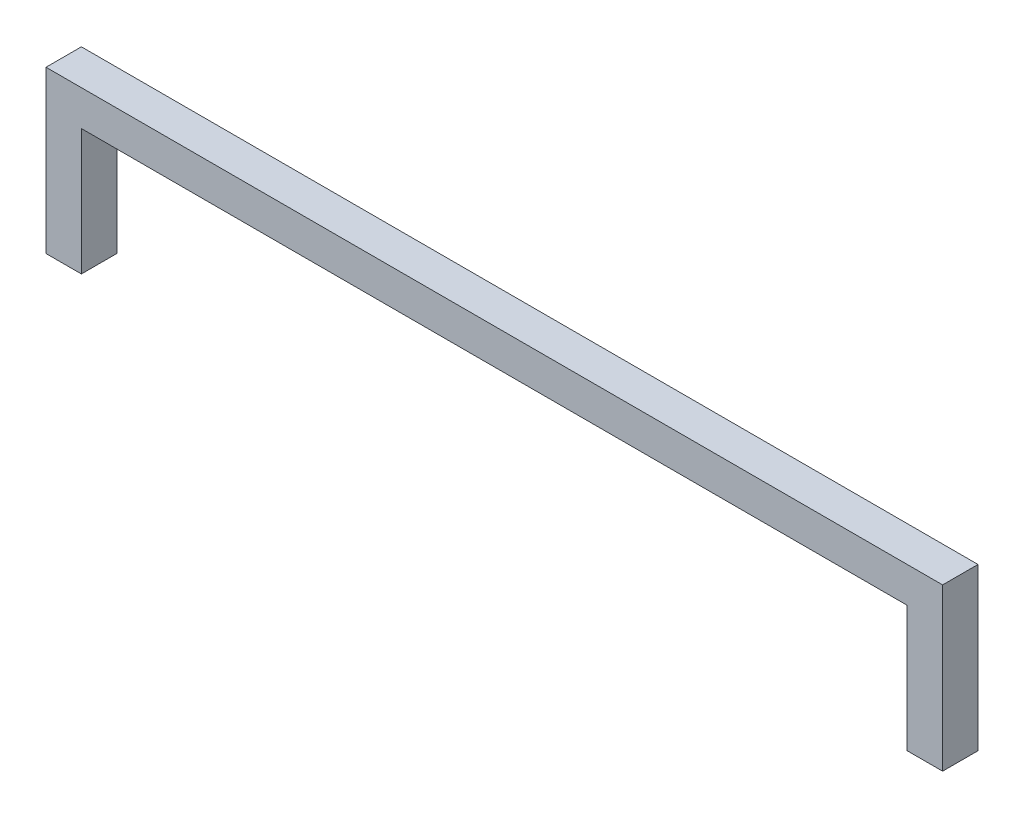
ISO-10303-21;
HEADER;
FILE_DESCRIPTION(('STEP AP214'),'2;1');
FILE_NAME('part.step','',(''),(''),'','','');
FILE_SCHEMA(('AUTOMOTIVE_DESIGN { 1 0 10303 214 1 1 1 1 }'));
ENDSEC;
DATA;
#1=APPLICATION_CONTEXT('core data for automotive mechanical design processes');
#2=APPLICATION_PROTOCOL_DEFINITION('international standard','automotive_design',2000,#1);
#3=PRODUCT_CONTEXT('',#1,'mechanical');
#4=PRODUCT('Part','Part','',(#3));
#5=PRODUCT_RELATED_PRODUCT_CATEGORY('part','',(#4));
#6=PRODUCT_DEFINITION_FORMATION('','',#4);
#7=PRODUCT_DEFINITION_CONTEXT('part definition',#1,'design');
#8=PRODUCT_DEFINITION('design','',#6,#7);
#9=PRODUCT_DEFINITION_SHAPE('','',#8);
#10=(LENGTH_UNIT() NAMED_UNIT(*) SI_UNIT(.MILLI.,.METRE.));
#11=(NAMED_UNIT(*) PLANE_ANGLE_UNIT() SI_UNIT($,.RADIAN.));
#12=(NAMED_UNIT(*) SI_UNIT($,.STERADIAN.) SOLID_ANGLE_UNIT());
#13=UNCERTAINTY_MEASURE_WITH_UNIT(LENGTH_MEASURE(1.E-05),#10,'distance_accuracy_value','');
#14=(GEOMETRIC_REPRESENTATION_CONTEXT(3) GLOBAL_UNCERTAINTY_ASSIGNED_CONTEXT((#13)) GLOBAL_UNIT_ASSIGNED_CONTEXT((#10,
#11,#12)) REPRESENTATION_CONTEXT('',''));
#15=CARTESIAN_POINT('',(0.,0.,0.));
#16=DIRECTION('',(0.,0.,1.));
#17=DIRECTION('',(1.,0.,0.));
#18=AXIS2_PLACEMENT_3D('',#15,#16,#17);
#19=CARTESIAN_POINT('',(700.,0.,0.));
#20=DIRECTION('',(0.,1.,0.));
#21=DIRECTION('',(0.,0.,-1.));
#22=AXIS2_PLACEMENT_3D('',#19,#20,#21);
#23=PLANE('',#22);
#24=DIRECTION('',(0.,0.,-1.));
#25=VECTOR('',#24,1.);
#26=CARTESIAN_POINT('',(700.,0.,0.));
#27=LINE('',#26,#25);
#28=CARTESIAN_POINT('',(700.,0.,30.));
#29=VERTEX_POINT('',#28);
#30=CARTESIAN_POINT('',(700.,0.,0.));
#31=VERTEX_POINT('',#30);
#32=EDGE_CURVE('E303',#29,#31,#27,.T.);
#33=ORIENTED_EDGE('',*,*,#32,.T.);
#34=DIRECTION('',(1.,0.,0.));
#35=VECTOR('',#34,1.);
#36=CARTESIAN_POINT('',(700.,0.,0.));
#37=LINE('',#36,#35);
#38=CARTESIAN_POINT('',(730.,0.,0.));
#39=VERTEX_POINT('',#38);
#40=EDGE_CURVE('E300',#31,#39,#37,.T.);
#41=ORIENTED_EDGE('',*,*,#40,.T.);
#42=DIRECTION('',(0.,0.,1.));
#43=VECTOR('',#42,1.);
#44=CARTESIAN_POINT('',(730.,0.,0.));
#45=LINE('',#44,#43);
#46=CARTESIAN_POINT('',(730.,0.,30.));
#47=VERTEX_POINT('',#46);
#48=EDGE_CURVE('E309',#39,#47,#45,.T.);
#49=ORIENTED_EDGE('',*,*,#48,.T.);
#50=DIRECTION('',(-1.,0.,0.));
#51=VECTOR('',#50,1.);
#52=CARTESIAN_POINT('',(700.,0.,30.));
#53=LINE('',#52,#51);
#54=EDGE_CURVE('E306',#47,#29,#53,.T.);
#55=ORIENTED_EDGE('',*,*,#54,.T.);
#56=EDGE_LOOP('',(#33,#41,#49,#55));
#57=FACE_BOUND('',#56,.T.);
#58=DIRECTION('',(0.,0.,-1.));
#59=VECTOR('',#58,1.);
#60=CARTESIAN_POINT('',(701.,0.,0.));
#61=LINE('',#60,#59);
#62=CARTESIAN_POINT('',(701.,0.,29.));
#63=VERTEX_POINT('',#62);
#64=CARTESIAN_POINT('',(701.,0.,1.));
#65=VERTEX_POINT('',#64);
#66=EDGE_CURVE('E221',#63,#65,#61,.T.);
#67=ORIENTED_EDGE('',*,*,#66,.F.);
#68=DIRECTION('',(-1.,0.,0.));
#69=VECTOR('',#68,1.);
#70=CARTESIAN_POINT('',(700.,0.,29.));
#71=LINE('',#70,#69);
#72=CARTESIAN_POINT('',(729.,0.,29.));
#73=VERTEX_POINT('',#72);
#74=EDGE_CURVE('E218',#73,#63,#71,.T.);
#75=ORIENTED_EDGE('',*,*,#74,.F.);
#76=DIRECTION('',(0.,0.,1.));
#77=VECTOR('',#76,1.);
#78=CARTESIAN_POINT('',(729.,0.,0.));
#79=LINE('',#78,#77);
#80=CARTESIAN_POINT('',(729.,0.,1.));
#81=VERTEX_POINT('',#80);
#82=EDGE_CURVE('E176',#81,#73,#79,.T.);
#83=ORIENTED_EDGE('',*,*,#82,.F.);
#84=DIRECTION('',(1.,0.,0.));
#85=VECTOR('',#84,1.);
#86=CARTESIAN_POINT('',(700.,0.,1.));
#87=LINE('',#86,#85);
#88=EDGE_CURVE('E224',#65,#81,#87,.T.);
#89=ORIENTED_EDGE('',*,*,#88,.F.);
#90=EDGE_LOOP('',(#67,#75,#83,#89));
#91=FACE_BOUND('',#90,.T.);
#92=ADVANCED_FACE('F46',(#57,#91),#23,.F.);
#93=CARTESIAN_POINT('',(0.,0.,0.));
#94=DIRECTION('',(0.,-1.,0.));
#95=DIRECTION('',(0.,0.,-1.));
#96=AXIS2_PLACEMENT_3D('',#93,#94,#95);
#97=PLANE('',#96);
#98=DIRECTION('',(0.,0.,-1.));
#99=VECTOR('',#98,1.);
#100=CARTESIAN_POINT('',(0.,0.,0.));
#101=LINE('',#100,#99);
#102=CARTESIAN_POINT('',(0.,0.,30.));
#103=VERTEX_POINT('',#102);
#104=CARTESIAN_POINT('',(0.,0.,0.));
#105=VERTEX_POINT('',#104);
#106=EDGE_CURVE('E260',#103,#105,#101,.T.);
#107=ORIENTED_EDGE('',*,*,#106,.F.);
#108=DIRECTION('',(1.,0.,0.));
#109=VECTOR('',#108,1.);
#110=CARTESIAN_POINT('',(0.,0.,30.));
#111=LINE('',#110,#109);
#112=CARTESIAN_POINT('',(-30.,0.,30.));
#113=VERTEX_POINT('',#112);
#114=EDGE_CURVE('E245',#113,#103,#111,.T.);
#115=ORIENTED_EDGE('',*,*,#114,.F.);
#116=DIRECTION('',(0.,0.,1.));
#117=VECTOR('',#116,1.);
#118=CARTESIAN_POINT('',(-30.,0.,0.));
#119=LINE('',#118,#117);
#120=CARTESIAN_POINT('',(-30.,0.,0.));
#121=VERTEX_POINT('',#120);
#122=EDGE_CURVE('E241',#121,#113,#119,.T.);
#123=ORIENTED_EDGE('',*,*,#122,.F.);
#124=DIRECTION('',(-1.,0.,0.));
#125=VECTOR('',#124,1.);
#126=CARTESIAN_POINT('',(0.,0.,0.));
#127=LINE('',#126,#125);
#128=EDGE_CURVE('E256',#105,#121,#127,.T.);
#129=ORIENTED_EDGE('',*,*,#128,.F.);
#130=EDGE_LOOP('',(#107,#115,#123,#129));
#131=FACE_BOUND('',#130,.T.);
#132=DIRECTION('',(1.,0.,0.));
#133=VECTOR('',#132,1.);
#134=CARTESIAN_POINT('',(0.,0.,29.));
#135=LINE('',#134,#133);
#136=CARTESIAN_POINT('',(-29.,0.,29.));
#137=VERTEX_POINT('',#136);
#138=CARTESIAN_POINT('',(-0.999999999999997,0.,29.));
#139=VERTEX_POINT('',#138);
#140=EDGE_CURVE('E233',#137,#139,#135,.T.);
#141=ORIENTED_EDGE('',*,*,#140,.T.);
#142=DIRECTION('',(0.,0.,-1.));
#143=VECTOR('',#142,1.);
#144=CARTESIAN_POINT('',(-1.,0.,0.));
#145=LINE('',#144,#143);
#146=CARTESIAN_POINT('',(-1.,0.,1.));
#147=VERTEX_POINT('',#146);
#148=EDGE_CURVE('E230',#139,#147,#145,.T.);
#149=ORIENTED_EDGE('',*,*,#148,.T.);
#150=DIRECTION('',(-1.,0.,0.));
#151=VECTOR('',#150,1.);
#152=CARTESIAN_POINT('',(0.,0.,1.));
#153=LINE('',#152,#151);
#154=CARTESIAN_POINT('',(-29.,0.,1.));
#155=VERTEX_POINT('',#154);
#156=EDGE_CURVE('E205',#147,#155,#153,.T.);
#157=ORIENTED_EDGE('',*,*,#156,.T.);
#158=DIRECTION('',(0.,0.,1.));
#159=VECTOR('',#158,1.);
#160=CARTESIAN_POINT('',(-29.,0.,0.));
#161=LINE('',#160,#159);
#162=EDGE_CURVE('E237',#155,#137,#161,.T.);
#163=ORIENTED_EDGE('',*,*,#162,.T.);
#164=EDGE_LOOP('',(#141,#149,#157,#163));
#165=FACE_BOUND('',#164,.T.);
#166=ADVANCED_FACE('F343',(#131,#165),#97,.T.);
#167=CARTESIAN_POINT('',(730.,139.87,0.));
#168=DIRECTION('',(1.,0.,0.));
#169=DIRECTION('',(0.,0.,-1.));
#170=AXIS2_PLACEMENT_3D('',#167,#168,#169);
#171=PLANE('',#170);
#172=DIRECTION('',(0.,0.,-1.));
#173=VECTOR('',#172,1.);
#174=CARTESIAN_POINT('',(730.,136.77,-3.48106075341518E-13));
#175=LINE('',#174,#173);
#176=CARTESIAN_POINT('',(730.,136.77,30.));
#177=VERTEX_POINT('',#176);
#178=CARTESIAN_POINT('',(730.,136.77,0.));
#179=VERTEX_POINT('',#178);
#180=EDGE_CURVE('E280',#177,#179,#175,.T.);
#181=ORIENTED_EDGE('',*,*,#180,.F.);
#182=DIRECTION('',(0.,-1.,0.));
#183=VECTOR('',#182,1.);
#184=CARTESIAN_POINT('',(730.,139.87,30.));
#185=LINE('',#184,#183);
#186=EDGE_CURVE('E319',#177,#47,#185,.T.);
#187=ORIENTED_EDGE('',*,*,#186,.T.);
#188=ORIENTED_EDGE('',*,*,#48,.F.);
#189=DIRECTION('',(0.,-1.,0.));
#190=VECTOR('',#189,1.);
#191=CARTESIAN_POINT('',(730.,139.87,0.));
#192=LINE('',#191,#190);
#193=EDGE_CURVE('E49',#179,#39,#192,.T.);
#194=ORIENTED_EDGE('',*,*,#193,.F.);
#195=EDGE_LOOP('',(#181,#187,#188,#194));
#196=FACE_BOUND('',#195,.T.);
#197=ADVANCED_FACE('F331',(#196),#171,.T.);
#198=CARTESIAN_POINT('',(700.,139.87,0.));
#199=DIRECTION('',(-1.,0.,0.));
#200=DIRECTION('',(0.,0.,1.));
#201=AXIS2_PLACEMENT_3D('',#198,#199,#200);
#202=PLANE('',#201);
#203=DIRECTION('',(0.,0.,1.));
#204=VECTOR('',#203,1.);
#205=CARTESIAN_POINT('',(700.,106.77,0.));
#206=LINE('',#205,#204);
#207=CARTESIAN_POINT('',(700.,106.77,0.));
#208=VERTEX_POINT('',#207);
#209=CARTESIAN_POINT('',(700.,106.77,30.));
#210=VERTEX_POINT('',#209);
#211=EDGE_CURVE('E246',#208,#210,#206,.T.);
#212=ORIENTED_EDGE('',*,*,#211,.F.);
#213=DIRECTION('',(0.,-1.,0.));
#214=VECTOR('',#213,1.);
#215=CARTESIAN_POINT('',(700.,139.87,0.));
#216=LINE('',#215,#214);
#217=EDGE_CURVE('E312',#208,#31,#216,.T.);
#218=ORIENTED_EDGE('',*,*,#217,.T.);
#219=ORIENTED_EDGE('',*,*,#32,.F.);
#220=DIRECTION('',(0.,-1.,0.));
#221=VECTOR('',#220,1.);
#222=CARTESIAN_POINT('',(700.,139.87,30.));
#223=LINE('',#222,#221);
#224=EDGE_CURVE('E316',#210,#29,#223,.T.);
#225=ORIENTED_EDGE('',*,*,#224,.F.);
#226=EDGE_LOOP('',(#212,#218,#219,#225));
#227=FACE_BOUND('',#226,.T.);
#228=ADVANCED_FACE('F353',(#227),#202,.T.);
#229=CARTESIAN_POINT('',(-33.1,106.77,0.));
#230=DIRECTION('',(0.,-1.,0.));
#231=DIRECTION('',(0.,0.,-1.));
#232=AXIS2_PLACEMENT_3D('',#229,#230,#231);
#233=PLANE('',#232);
#234=DIRECTION('',(1.,0.,0.));
#235=VECTOR('',#234,1.);
#236=CARTESIAN_POINT('',(-33.1,106.77,0.));
#237=LINE('',#236,#235);
#238=CARTESIAN_POINT('',(0.,106.77,0.));
#239=VERTEX_POINT('',#238);
#240=EDGE_CURVE('E281',#239,#208,#237,.T.);
#241=ORIENTED_EDGE('',*,*,#240,.T.);
#242=ORIENTED_EDGE('',*,*,#211,.T.);
#243=DIRECTION('',(1.,0.,0.));
#244=VECTOR('',#243,1.);
#245=CARTESIAN_POINT('',(-33.1,106.77,30.));
#246=LINE('',#245,#244);
#247=CARTESIAN_POINT('',(0.,106.77,30.));
#248=VERTEX_POINT('',#247);
#249=EDGE_CURVE('E285',#248,#210,#246,.T.);
#250=ORIENTED_EDGE('',*,*,#249,.F.);
#251=DIRECTION('',(0.,0.,1.));
#252=VECTOR('',#251,1.);
#253=CARTESIAN_POINT('',(0.,106.77,0.));
#254=LINE('',#253,#252);
#255=EDGE_CURVE('E11',#239,#248,#254,.T.);
#256=ORIENTED_EDGE('',*,*,#255,.F.);
#257=EDGE_LOOP('',(#241,#242,#250,#256));
#258=FACE_BOUND('',#257,.T.);
#259=ADVANCED_FACE('F351',(#258),#233,.T.);
#260=CARTESIAN_POINT('',(-33.1,136.77,0.));
#261=DIRECTION('',(0.,1.,0.));
#262=DIRECTION('',(0.,0.,1.));
#263=AXIS2_PLACEMENT_3D('',#260,#261,#262);
#264=PLANE('',#263);
#265=DIRECTION('',(1.,0.,0.));
#266=VECTOR('',#265,1.);
#267=CARTESIAN_POINT('',(-33.1,136.77,30.));
#268=LINE('',#267,#266);
#269=CARTESIAN_POINT('',(-30.,136.77,30.));
#270=VERTEX_POINT('',#269);
#271=EDGE_CURVE('E289',#270,#177,#268,.T.);
#272=ORIENTED_EDGE('',*,*,#271,.T.);
#273=ORIENTED_EDGE('',*,*,#180,.T.);
#274=DIRECTION('',(1.,0.,0.));
#275=VECTOR('',#274,1.);
#276=CARTESIAN_POINT('',(-33.1,136.77,0.));
#277=LINE('',#276,#275);
#278=CARTESIAN_POINT('',(-30.,136.77,0.));
#279=VERTEX_POINT('',#278);
#280=EDGE_CURVE('E293',#279,#179,#277,.T.);
#281=ORIENTED_EDGE('',*,*,#280,.F.);
#282=DIRECTION('',(0.,0.,-1.));
#283=VECTOR('',#282,1.);
#284=CARTESIAN_POINT('',(-30.,136.77,0.));
#285=LINE('',#284,#283);
#286=EDGE_CURVE('E55',#270,#279,#285,.T.);
#287=ORIENTED_EDGE('',*,*,#286,.F.);
#288=EDGE_LOOP('',(#272,#273,#281,#287));
#289=FACE_BOUND('',#288,.T.);
#290=ADVANCED_FACE('F333',(#289),#264,.T.);
#291=CARTESIAN_POINT('',(0.,0.,0.));
#292=DIRECTION('',(0.,0.,-1.));
#293=DIRECTION('',(-1.,0.,0.));
#294=AXIS2_PLACEMENT_3D('',#291,#292,#293);
#295=PLANE('',#294);
#296=DIRECTION('',(0.,1.,0.));
#297=VECTOR('',#296,1.);
#298=CARTESIAN_POINT('',(-30.,0.,0.));
#299=LINE('',#298,#297);
#300=EDGE_CURVE('E252',#121,#279,#299,.T.);
#301=ORIENTED_EDGE('',*,*,#300,.T.);
#302=ORIENTED_EDGE('',*,*,#280,.T.);
#303=ORIENTED_EDGE('',*,*,#193,.T.);
#304=ORIENTED_EDGE('',*,*,#40,.F.);
#305=ORIENTED_EDGE('',*,*,#217,.F.);
#306=ORIENTED_EDGE('',*,*,#240,.F.);
#307=DIRECTION('',(0.,1.,0.));
#308=VECTOR('',#307,1.);
#309=CARTESIAN_POINT('',(0.,0.,0.));
#310=LINE('',#309,#308);
#311=EDGE_CURVE('E264',#105,#239,#310,.T.);
#312=ORIENTED_EDGE('',*,*,#311,.F.);
#313=ORIENTED_EDGE('',*,*,#128,.T.);
#314=EDGE_LOOP('',(#301,#302,#303,#304,#305,#306,#312,#313));
#315=FACE_BOUND('',#314,.T.);
#316=ADVANCED_FACE('F329',(#315),#295,.T.);
#317=CARTESIAN_POINT('',(0.,0.,0.));
#318=DIRECTION('',(1.,0.,0.));
#319=DIRECTION('',(0.,0.,-1.));
#320=AXIS2_PLACEMENT_3D('',#317,#318,#319);
#321=PLANE('',#320);
#322=ORIENTED_EDGE('',*,*,#311,.T.);
#323=ORIENTED_EDGE('',*,*,#255,.T.);
#324=DIRECTION('',(0.,1.,0.));
#325=VECTOR('',#324,1.);
#326=CARTESIAN_POINT('',(0.,0.,30.));
#327=LINE('',#326,#325);
#328=EDGE_CURVE('E251',#103,#248,#327,.T.);
#329=ORIENTED_EDGE('',*,*,#328,.F.);
#330=ORIENTED_EDGE('',*,*,#106,.T.);
#331=EDGE_LOOP('',(#322,#323,#329,#330));
#332=FACE_BOUND('',#331,.T.);
#333=ADVANCED_FACE('F348',(#332),#321,.T.);
#334=CARTESIAN_POINT('',(0.,0.,30.));
#335=DIRECTION('',(0.,0.,1.));
#336=DIRECTION('',(1.,0.,0.));
#337=AXIS2_PLACEMENT_3D('',#334,#335,#336);
#338=PLANE('',#337);
#339=ORIENTED_EDGE('',*,*,#328,.T.);
#340=ORIENTED_EDGE('',*,*,#249,.T.);
#341=ORIENTED_EDGE('',*,*,#224,.T.);
#342=ORIENTED_EDGE('',*,*,#54,.F.);
#343=ORIENTED_EDGE('',*,*,#186,.F.);
#344=ORIENTED_EDGE('',*,*,#271,.F.);
#345=DIRECTION('',(0.,1.,0.));
#346=VECTOR('',#345,1.);
#347=CARTESIAN_POINT('',(-30.,0.,30.));
#348=LINE('',#347,#346);
#349=EDGE_CURVE('E247',#113,#270,#348,.T.);
#350=ORIENTED_EDGE('',*,*,#349,.F.);
#351=ORIENTED_EDGE('',*,*,#114,.T.);
#352=EDGE_LOOP('',(#339,#340,#341,#342,#343,#344,#350,#351));
#353=FACE_BOUND('',#352,.T.);
#354=ADVANCED_FACE('F337',(#353),#338,.T.);
#355=CARTESIAN_POINT('',(-30.,0.,0.));
#356=DIRECTION('',(-1.,0.,0.));
#357=DIRECTION('',(0.,0.,1.));
#358=AXIS2_PLACEMENT_3D('',#355,#356,#357);
#359=PLANE('',#358);
#360=ORIENTED_EDGE('',*,*,#349,.T.);
#361=ORIENTED_EDGE('',*,*,#286,.T.);
#362=ORIENTED_EDGE('',*,*,#300,.F.);
#363=ORIENTED_EDGE('',*,*,#122,.T.);
#364=EDGE_LOOP('',(#360,#361,#362,#363));
#365=FACE_BOUND('',#364,.T.);
#366=ADVANCED_FACE('F340',(#365),#359,.T.);
#367=CARTESIAN_POINT('',(729.,139.87,0.));
#368=DIRECTION('',(1.,0.,0.));
#369=DIRECTION('',(0.,0.,-1.));
#370=AXIS2_PLACEMENT_3D('',#367,#368,#369);
#371=PLANE('',#370);
#372=DIRECTION('',(0.,0.,-1.));
#373=VECTOR('',#372,1.);
#374=CARTESIAN_POINT('',(729.,135.77,-3.47180889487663E-13));
#375=LINE('',#374,#373);
#376=CARTESIAN_POINT('',(729.,135.77,29.));
#377=VERTEX_POINT('',#376);
#378=CARTESIAN_POINT('',(729.,135.77,1.));
#379=VERTEX_POINT('',#378);
#380=EDGE_CURVE('E163',#377,#379,#375,.T.);
#381=ORIENTED_EDGE('',*,*,#380,.T.);
#382=DIRECTION('',(0.,-1.,0.));
#383=VECTOR('',#382,1.);
#384=CARTESIAN_POINT('',(729.,139.87,1.));
#385=LINE('',#384,#383);
#386=EDGE_CURVE('E179',#379,#81,#385,.T.);
#387=ORIENTED_EDGE('',*,*,#386,.T.);
#388=ORIENTED_EDGE('',*,*,#82,.T.);
#389=DIRECTION('',(0.,-1.,0.));
#390=VECTOR('',#389,1.);
#391=CARTESIAN_POINT('',(729.,139.87,29.));
#392=LINE('',#391,#390);
#393=EDGE_CURVE('E63',#377,#73,#392,.T.);
#394=ORIENTED_EDGE('',*,*,#393,.F.);
#395=EDGE_LOOP('',(#381,#387,#388,#394));
#396=FACE_BOUND('',#395,.T.);
#397=ADVANCED_FACE('F174',(#396),#371,.F.);
#398=CARTESIAN_POINT('',(700.,139.87,29.));
#399=DIRECTION('',(0.,0.,1.));
#400=DIRECTION('',(1.,0.,0.));
#401=AXIS2_PLACEMENT_3D('',#398,#399,#400);
#402=PLANE('',#401);
#403=DIRECTION('',(0.,-1.,0.));
#404=VECTOR('',#403,1.);
#405=CARTESIAN_POINT('',(701.,139.87,29.));
#406=LINE('',#405,#404);
#407=CARTESIAN_POINT('',(701.,107.77,29.));
#408=VERTEX_POINT('',#407);
#409=EDGE_CURVE('E180',#408,#63,#406,.T.);
#410=ORIENTED_EDGE('',*,*,#409,.F.);
#411=DIRECTION('',(1.,0.,0.));
#412=VECTOR('',#411,1.);
#413=CARTESIAN_POINT('',(-33.1,107.77,29.));
#414=LINE('',#413,#412);
#415=CARTESIAN_POINT('',(-0.999999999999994,107.77,29.));
#416=VERTEX_POINT('',#415);
#417=EDGE_CURVE('E186',#416,#408,#414,.T.);
#418=ORIENTED_EDGE('',*,*,#417,.F.);
#419=DIRECTION('',(0.,1.,0.));
#420=VECTOR('',#419,1.);
#421=CARTESIAN_POINT('',(-0.999999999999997,0.,29.));
#422=LINE('',#421,#420);
#423=EDGE_CURVE('E209',#139,#416,#422,.T.);
#424=ORIENTED_EDGE('',*,*,#423,.F.);
#425=ORIENTED_EDGE('',*,*,#140,.F.);
#426=DIRECTION('',(0.,1.,0.));
#427=VECTOR('',#426,1.);
#428=CARTESIAN_POINT('',(-29.,0.,29.));
#429=LINE('',#428,#427);
#430=CARTESIAN_POINT('',(-29.,135.77,29.));
#431=VERTEX_POINT('',#430);
#432=EDGE_CURVE('E184',#137,#431,#429,.T.);
#433=ORIENTED_EDGE('',*,*,#432,.T.);
#434=DIRECTION('',(1.,0.,0.));
#435=VECTOR('',#434,1.);
#436=CARTESIAN_POINT('',(-33.1,135.77,29.));
#437=LINE('',#436,#435);
#438=EDGE_CURVE('E166',#431,#377,#437,.T.);
#439=ORIENTED_EDGE('',*,*,#438,.T.);
#440=ORIENTED_EDGE('',*,*,#393,.T.);
#441=ORIENTED_EDGE('',*,*,#74,.T.);
#442=EDGE_LOOP('',(#410,#418,#424,#425,#433,#439,#440,#441));
#443=FACE_BOUND('',#442,.T.);
#444=ADVANCED_FACE('F182',(#443),#402,.F.);
#445=CARTESIAN_POINT('',(701.,139.87,0.));
#446=DIRECTION('',(-1.,0.,0.));
#447=DIRECTION('',(0.,0.,1.));
#448=AXIS2_PLACEMENT_3D('',#445,#446,#447);
#449=PLANE('',#448);
#450=DIRECTION('',(0.,0.,1.));
#451=VECTOR('',#450,1.);
#452=CARTESIAN_POINT('',(701.,107.77,0.));
#453=LINE('',#452,#451);
#454=CARTESIAN_POINT('',(701.,107.77,1.));
#455=VERTEX_POINT('',#454);
#456=EDGE_CURVE('E172',#455,#408,#453,.T.);
#457=ORIENTED_EDGE('',*,*,#456,.T.);
#458=ORIENTED_EDGE('',*,*,#409,.T.);
#459=ORIENTED_EDGE('',*,*,#66,.T.);
#460=DIRECTION('',(0.,-1.,0.));
#461=VECTOR('',#460,1.);
#462=CARTESIAN_POINT('',(701.,139.87,1.));
#463=LINE('',#462,#461);
#464=EDGE_CURVE('E217',#455,#65,#463,.T.);
#465=ORIENTED_EDGE('',*,*,#464,.F.);
#466=EDGE_LOOP('',(#457,#458,#459,#465));
#467=FACE_BOUND('',#466,.T.);
#468=ADVANCED_FACE('F365',(#467),#449,.F.);
#469=CARTESIAN_POINT('',(700.,139.87,1.));
#470=DIRECTION('',(0.,0.,-1.));
#471=DIRECTION('',(-1.,0.,0.));
#472=AXIS2_PLACEMENT_3D('',#469,#470,#471);
#473=PLANE('',#472);
#474=ORIENTED_EDGE('',*,*,#386,.F.);
#475=DIRECTION('',(1.,0.,0.));
#476=VECTOR('',#475,1.);
#477=CARTESIAN_POINT('',(-33.1,135.77,1.));
#478=LINE('',#477,#476);
#479=CARTESIAN_POINT('',(-29.,135.77,1.));
#480=VERTEX_POINT('',#479);
#481=EDGE_CURVE('E168',#480,#379,#478,.T.);
#482=ORIENTED_EDGE('',*,*,#481,.F.);
#483=DIRECTION('',(0.,1.,0.));
#484=VECTOR('',#483,1.);
#485=CARTESIAN_POINT('',(-29.,0.,1.));
#486=LINE('',#485,#484);
#487=EDGE_CURVE('E71',#155,#480,#486,.T.);
#488=ORIENTED_EDGE('',*,*,#487,.F.);
#489=ORIENTED_EDGE('',*,*,#156,.F.);
#490=DIRECTION('',(0.,1.,0.));
#491=VECTOR('',#490,1.);
#492=CARTESIAN_POINT('',(-1.,0.,1.));
#493=LINE('',#492,#491);
#494=CARTESIAN_POINT('',(-0.999999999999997,107.77,1.));
#495=VERTEX_POINT('',#494);
#496=EDGE_CURVE('E202',#147,#495,#493,.T.);
#497=ORIENTED_EDGE('',*,*,#496,.T.);
#498=DIRECTION('',(1.,0.,0.));
#499=VECTOR('',#498,1.);
#500=CARTESIAN_POINT('',(-33.1,107.77,1.));
#501=LINE('',#500,#499);
#502=EDGE_CURVE('E194',#495,#455,#501,.T.);
#503=ORIENTED_EDGE('',*,*,#502,.T.);
#504=ORIENTED_EDGE('',*,*,#464,.T.);
#505=ORIENTED_EDGE('',*,*,#88,.T.);
#506=EDGE_LOOP('',(#474,#482,#488,#489,#497,#503,#504,#505));
#507=FACE_BOUND('',#506,.T.);
#508=ADVANCED_FACE('F367',(#507),#473,.F.);
#509=CARTESIAN_POINT('',(-33.1,107.77,0.));
#510=DIRECTION('',(0.,-1.,0.));
#511=DIRECTION('',(0.,0.,-1.));
#512=AXIS2_PLACEMENT_3D('',#509,#510,#511);
#513=PLANE('',#512);
#514=ORIENTED_EDGE('',*,*,#502,.F.);
#515=DIRECTION('',(0.,0.,1.));
#516=VECTOR('',#515,1.);
#517=CARTESIAN_POINT('',(-1.,107.77,0.));
#518=LINE('',#517,#516);
#519=EDGE_CURVE('E198',#495,#416,#518,.T.);
#520=ORIENTED_EDGE('',*,*,#519,.T.);
#521=ORIENTED_EDGE('',*,*,#417,.T.);
#522=ORIENTED_EDGE('',*,*,#456,.F.);
#523=EDGE_LOOP('',(#514,#520,#521,#522));
#524=FACE_BOUND('',#523,.T.);
#525=ADVANCED_FACE('F386',(#524),#513,.F.);
#526=CARTESIAN_POINT('',(-33.1,135.77,0.));
#527=DIRECTION('',(0.,1.,0.));
#528=DIRECTION('',(0.,0.,1.));
#529=AXIS2_PLACEMENT_3D('',#526,#527,#528);
#530=PLANE('',#529);
#531=ORIENTED_EDGE('',*,*,#438,.F.);
#532=DIRECTION('',(0.,0.,-1.));
#533=VECTOR('',#532,1.);
#534=CARTESIAN_POINT('',(-29.,135.77,0.));
#535=LINE('',#534,#533);
#536=EDGE_CURVE('E199',#431,#480,#535,.T.);
#537=ORIENTED_EDGE('',*,*,#536,.T.);
#538=ORIENTED_EDGE('',*,*,#481,.T.);
#539=ORIENTED_EDGE('',*,*,#380,.F.);
#540=EDGE_LOOP('',(#531,#537,#538,#539));
#541=FACE_BOUND('',#540,.T.);
#542=ADVANCED_FACE('F164',(#541),#530,.F.);
#543=CARTESIAN_POINT('',(-1.,0.,0.));
#544=DIRECTION('',(1.,0.,0.));
#545=DIRECTION('',(0.,0.,-1.));
#546=AXIS2_PLACEMENT_3D('',#543,#544,#545);
#547=PLANE('',#546);
#548=ORIENTED_EDGE('',*,*,#496,.F.);
#549=ORIENTED_EDGE('',*,*,#148,.F.);
#550=ORIENTED_EDGE('',*,*,#423,.T.);
#551=ORIENTED_EDGE('',*,*,#519,.F.);
#552=EDGE_LOOP('',(#548,#549,#550,#551));
#553=FACE_BOUND('',#552,.T.);
#554=ADVANCED_FACE('F381',(#553),#547,.F.);
#555=CARTESIAN_POINT('',(-29.,0.,0.));
#556=DIRECTION('',(-1.,0.,0.));
#557=DIRECTION('',(0.,0.,1.));
#558=AXIS2_PLACEMENT_3D('',#555,#556,#557);
#559=PLANE('',#558);
#560=ORIENTED_EDGE('',*,*,#432,.F.);
#561=ORIENTED_EDGE('',*,*,#162,.F.);
#562=ORIENTED_EDGE('',*,*,#487,.T.);
#563=ORIENTED_EDGE('',*,*,#536,.F.);
#564=EDGE_LOOP('',(#560,#561,#562,#563));
#565=FACE_BOUND('',#564,.T.);
#566=ADVANCED_FACE('F378',(#565),#559,.F.);
#567=CLOSED_SHELL('',(#92,#166,#197,#228,#259,#290,#316,#333,#354,#366,#397,#444,#468,#508,#525,
#542,#554,#566));
#568=MANIFOLD_SOLID_BREP('B2',#567);
#569=ADVANCED_BREP_SHAPE_REPRESENTATION('',(#18,#568),#14);
#570=SHAPE_DEFINITION_REPRESENTATION(#9,#569);
ENDSEC;
END-ISO-10303-21;
